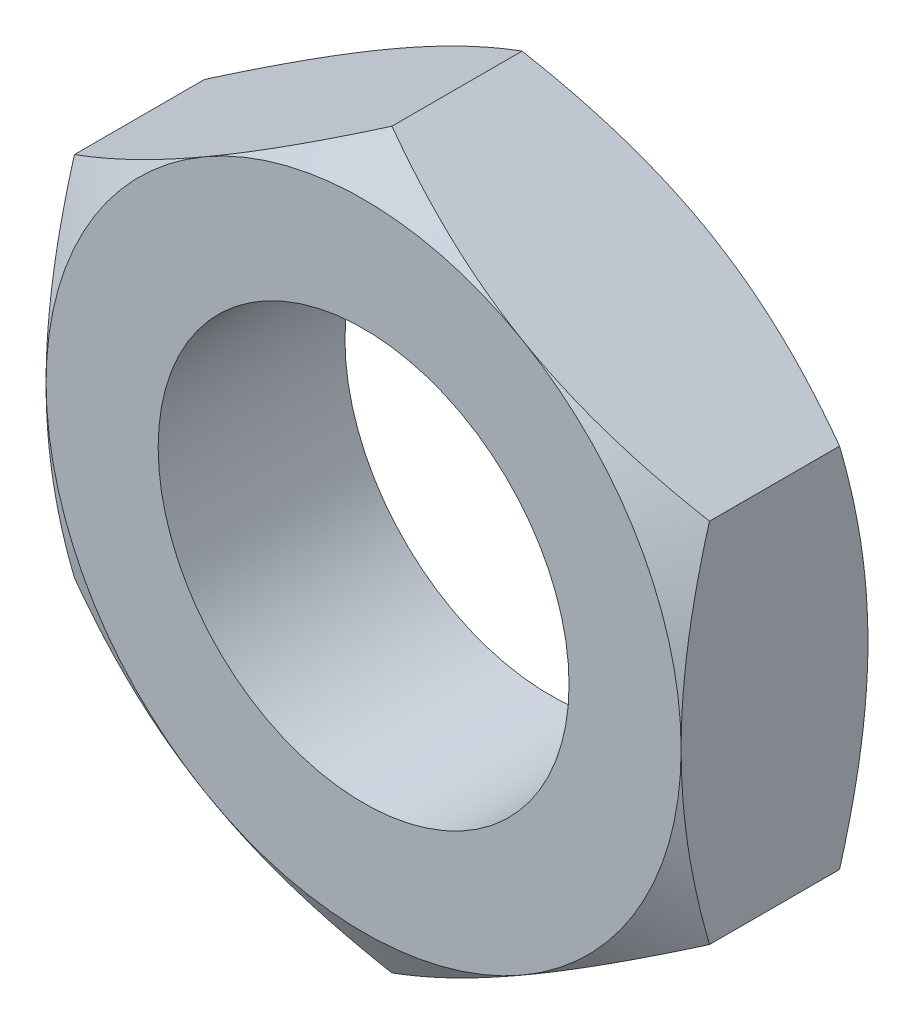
from build123d import *

# Parameters (mm, degrees)
BASE_EXTRUSION_DEPTH    = 10
ESQUISSE3_R             = 11
ENL_V_MAT_EXTRU_1_DEPTH = 28.826845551


with BuildPart() as part:
    # Esquisse1 → Base-Extrusion (new body)
    with BuildSketch(Plane.XY):
        Polygon((17, -9.814954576), (17, 9.814954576), (0, 19.629909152), (-17, 9.814954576), (-17, -9.814954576), (0, -19.629909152), align=None)
    extrude(amount=-BASE_EXTRUSION_DEPTH)

    # Esquisse2 → Enl_vement de mati_re-R_volution1 (revolve, cut)
    with BuildSketch(Plane(origin=(0, 0, 0), x_dir=(1, 0, 0), z_dir=(0, 1, 0))):
        Polygon((-17, 0), (-26.660254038, 0), (-26.660254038, 10), (-17, 10), (-25.660254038, 5), align=None)
    revolve(axis=Axis((0, 0, -10), (0, 0, 1)), mode=Mode.SUBTRACT)

    # Esquisse3 → Enl_v. mat.-Extru.1 (cut, through all)
    with BuildSketch(Plane.XY):
        Circle(ESQUISSE3_R)
    extrude(amount=-ENL_V_MAT_EXTRU_1_DEPTH, mode=Mode.SUBTRACT)


solid = part.part
